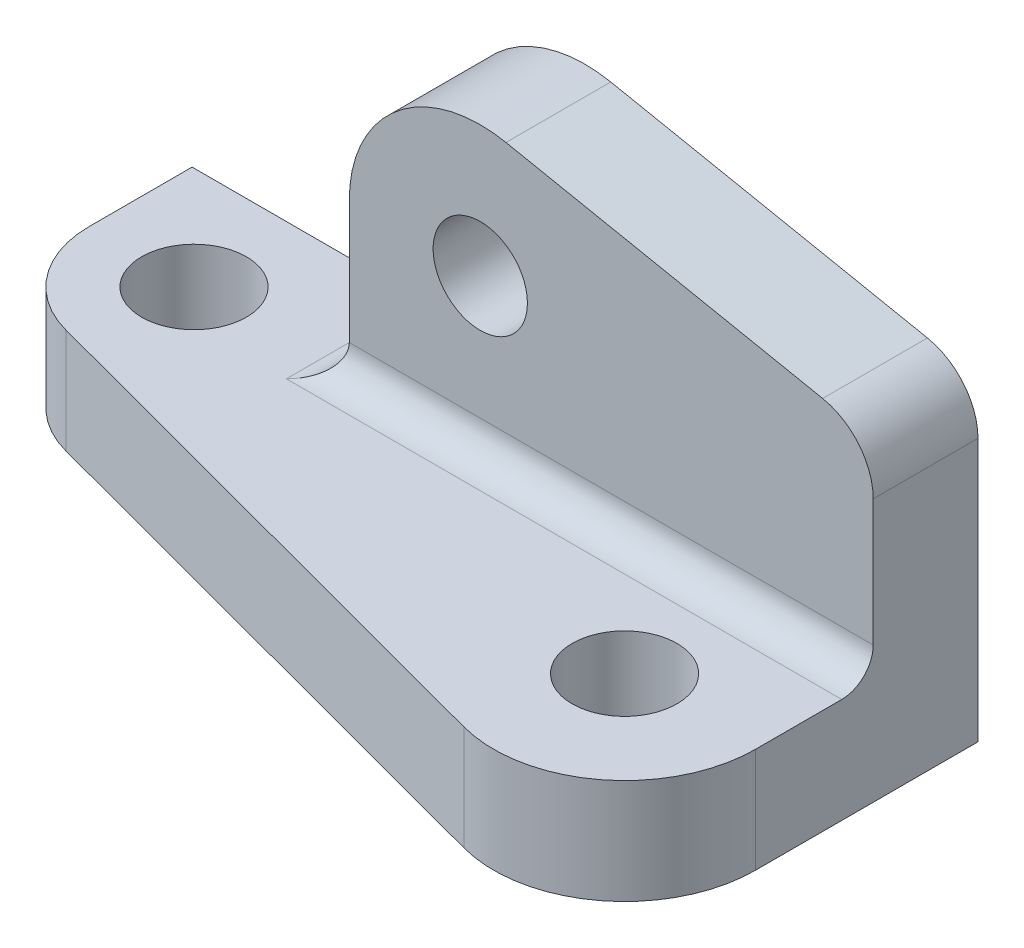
from build123d import *

# Parameters (mm, degrees)
EXTRUDE1_DEPTH            = 20
EXTRUDE2_DEPTH            = 20
FILLET1_R                 = 25
FILLET2_R                 = 20
FILLET3_R                 = 12
FILLET4_R                 = 6
M20_0_20_DIAMETER_HOLE1_D = 20
M18_0_18_DIAMETER_HOLE1_D = 18


with BuildPart() as part:
    # Sketch1 → Extrude1 (new body)
    with BuildSketch(Plane(origin=(0, 0, 0), x_dir=(1, 0, 0), z_dir=(0, 1, 0))):
        Polygon((0, 0), (150, 0), (150, -75), (0, -35), align=None)
    extrude(amount=EXTRUDE1_DEPTH)

    # Sketch2 → Extrude2 (add)
    with BuildSketch(Plane(origin=(0, 0, 0), x_dir=(-1, 0, 0), z_dir=(0, 0, -1))):
        Polygon((-150, 0), (-50, 0), (-50, 80), (-150, 60), align=None)
    extrude(amount=-EXTRUDE2_DEPTH)

    # Fillet1
    fillet1_edges = [part.edges().sort_by_distance(p)[0] for p in [
        (50, 80, 10),
        (150, 10, 75),
    ]]
    fillet(fillet1_edges, radius=FILLET1_R)

    # Fillet2
    fillet2_edges = [part.edges().sort_by_distance(p)[0] for p in [
        (0, 10, 35),
    ]]
    fillet(fillet2_edges, radius=FILLET2_R)

    # Fillet3
    fillet3_edges = [part.edges().sort_by_distance(p)[0] for p in [
        (150, 60, 10),
    ]]
    fillet(fillet3_edges, radius=FILLET3_R)

    # Fillet4
    fillet4_edges = [part.edges().sort_by_distance(p)[0] for p in [
        (50, 20, 10),
        (100, 20, 20),
    ]]
    fillet(fillet4_edges, radius=FILLET4_R)

    # M20.0 _20_ Diameter Hole1 (through all)
    with Locations(Plane(origin=(0, 20, 0), x_dir=(-1, 0, 0), z_dir=(0, 1, 0))):
        with Locations((-125, 42.45970884), (-20, 19.634433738)):
            Hole(M20_0_20_DIAMETER_HOLE1_D / 2)

    # M18.0 _18_ Diameter Hole1 (through all)
    with Locations(Plane(origin=(130.879919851, 20.264222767, 20), x_dir=(1, 0, 0), z_dir=(0, 0, 1))):
        with Locations((-55.879919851, 29.240679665)):
            Hole(M18_0_18_DIAMETER_HOLE1_D / 2)


solid = part.part
